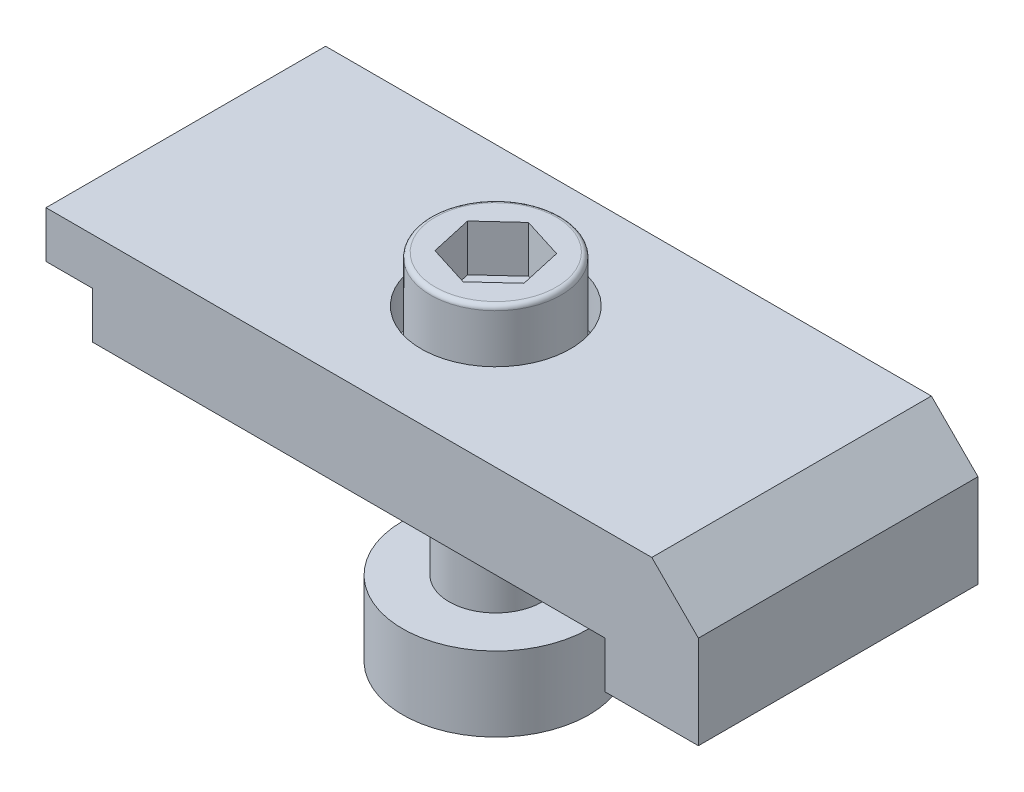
from build123d import *

# Parameters (mm, degrees)
EXTRUSION1_DEPTH        = 15
CHANFREIN1_SIZE         = 5
ESQUISSE2_R             = 8
ENL_V_MAT_EXTRU_1_DEPTH = 5
ESQUISSE3_R             = 7
EXTRUSION2_DEPTH        = 10
ENL_V_MAT_EXTRU_2_DEPTH = 6
CONG_1_R                = 0.5
ESQUISSE5_R             = 5
EXTRUSION3_DEPTH        = 33
ESQUISSE6_R             = 10
EXTRUSION4_DEPTH        = 8


with BuildPart() as part:
    # Esquisse1 → Extrusion1 (new, symmetric)
    with BuildSketch(Plane.XY):
        Polygon((0, 0), (-10, 0), (-10, 5), (-65, 5), (-65, 10), (-70, 10), (-70, 15), (0, 15), align=None)
    extrude(amount=EXTRUSION1_DEPTH, both=True)

    # Chanfrein1
    chanfrein1_edges = [part.edges().sort_by_distance(p)[0] for p in [
        (0, 15, 0),
    ]]
    chamfer(chanfrein1_edges, length=CHANFREIN1_SIZE)

    # Esquisse2 → Enl_v. mat.-Extru.1 (cut)
    with BuildSketch(Plane(origin=(0, 15, 0), x_dir=(-1, 0, 0), z_dir=(0, 1, 0))):
        with Locations((36.739467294, 0)):
            Circle(ESQUISSE2_R)
    extrude(amount=-ENL_V_MAT_EXTRU_1_DEPTH, mode=Mode.SUBTRACT)

    # Esquisse3 → Extrusion2 (add)
    with BuildSketch(Plane(origin=(0, 10, 0), x_dir=(-1, 0, 0), z_dir=(0, 1, 0))):
        with Locations((36.739467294, 0)):
            Circle(ESQUISSE3_R)
    extrude(amount=EXTRUSION2_DEPTH)

    # Esquisse4 → Enl_v. mat.-Extru.2 (cut)
    with BuildSketch(Plane(origin=(0, 20, 0), x_dir=(-1, 0, 0), z_dir=(0, 1, 0))):
        Polygon((33.339245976, -3.125992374), (37.746545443, -4.507674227), (41.146766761, -1.381681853), (40.139688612, 3.125992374), (35.732389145, 4.507674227), (32.332167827, 1.381681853), align=None)
    extrude(amount=-ENL_V_MAT_EXTRU_2_DEPTH, mode=Mode.SUBTRACT)

    # Cong_1
    cong_1_edges = [part.edges().sort_by_distance(p)[0] for p in [
        (-29.739467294, 20, 0),
    ]]
    fillet(cong_1_edges, radius=CONG_1_R)

    # Esquisse5 → Extrusion3 (add)
    with BuildSketch(Plane(origin=(0, 15, 0), x_dir=(-1, 0, 0), z_dir=(0, 1, 0))):
        with Locations((36.739467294, 0)):
            Circle(ESQUISSE5_R)
    extrude(amount=-EXTRUSION3_DEPTH)

    # Esquisse6 → Extrusion4 (add)
    with BuildSketch(Plane.XZ.offset(18)):
        with Locations((-36.739467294, 0)):
            Circle(ESQUISSE6_R)
    extrude(amount=-EXTRUSION4_DEPTH)


solid = part.part
